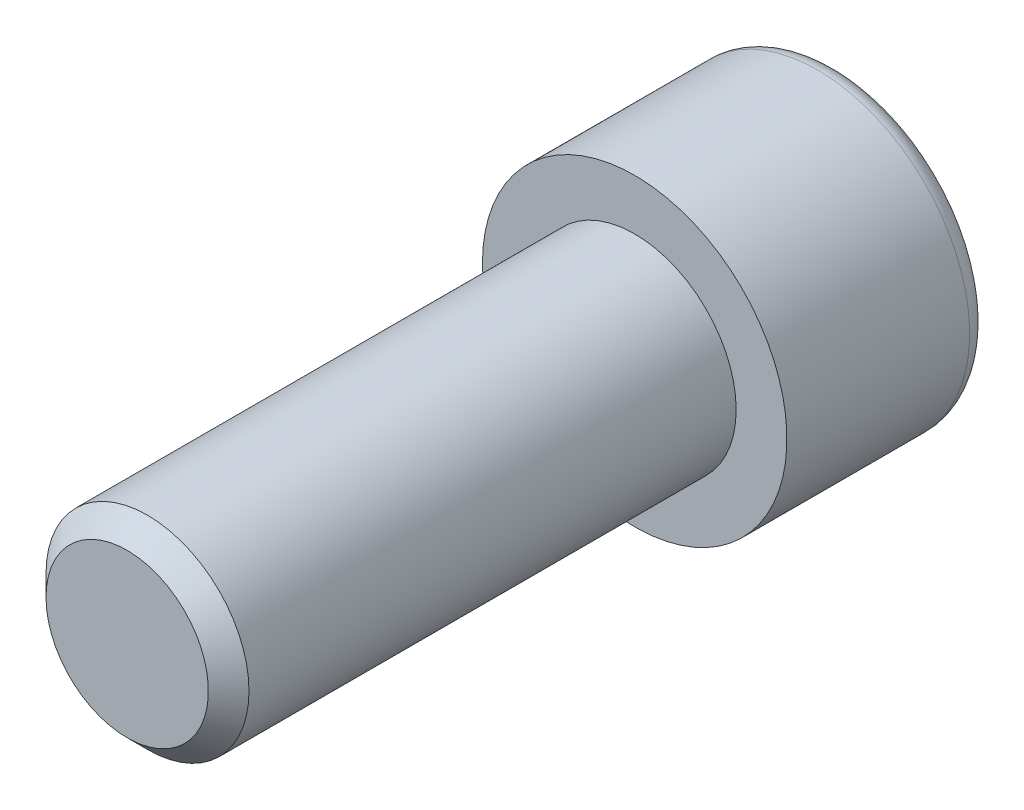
ISO-10303-21;
HEADER;
FILE_DESCRIPTION(('STEP AP214'),'2;1');
FILE_NAME('part.step','',(''),(''),'','','');
FILE_SCHEMA(('AUTOMOTIVE_DESIGN { 1 0 10303 214 1 1 1 1 }'));
ENDSEC;
DATA;
#1=APPLICATION_CONTEXT('core data for automotive mechanical design processes');
#2=APPLICATION_PROTOCOL_DEFINITION('international standard','automotive_design',2000,#1);
#3=PRODUCT_CONTEXT('',#1,'mechanical');
#4=PRODUCT('Part','Part','',(#3));
#5=PRODUCT_RELATED_PRODUCT_CATEGORY('part','',(#4));
#6=PRODUCT_DEFINITION_FORMATION('','',#4);
#7=PRODUCT_DEFINITION_CONTEXT('part definition',#1,'design');
#8=PRODUCT_DEFINITION('design','',#6,#7);
#9=PRODUCT_DEFINITION_SHAPE('','',#8);
#10=(LENGTH_UNIT() NAMED_UNIT(*) SI_UNIT(.MILLI.,.METRE.));
#11=(NAMED_UNIT(*) PLANE_ANGLE_UNIT() SI_UNIT($,.RADIAN.));
#12=(NAMED_UNIT(*) SI_UNIT($,.STERADIAN.) SOLID_ANGLE_UNIT());
#13=UNCERTAINTY_MEASURE_WITH_UNIT(LENGTH_MEASURE(1.E-05),#10,'distance_accuracy_value','');
#14=(GEOMETRIC_REPRESENTATION_CONTEXT(3) GLOBAL_UNCERTAINTY_ASSIGNED_CONTEXT((#13)) GLOBAL_UNIT_ASSIGNED_CONTEXT((#10,
#11,#12)) REPRESENTATION_CONTEXT('',''));
#15=CARTESIAN_POINT('',(0.,0.,0.));
#16=DIRECTION('',(0.,0.,1.));
#17=DIRECTION('',(1.,0.,0.));
#18=AXIS2_PLACEMENT_3D('',#15,#16,#17);
#19=CARTESIAN_POINT('',(0.,0.,-12.));
#20=DIRECTION('',(0.,0.,1.));
#21=DIRECTION('',(1.,0.,0.));
#22=AXIS2_PLACEMENT_3D('',#19,#20,#21);
#23=PLANE('',#22);
#24=CARTESIAN_POINT('',(0.,0.,-12.));
#25=DIRECTION('',(0.,0.,-1.));
#26=DIRECTION('',(-1.,0.,0.));
#27=AXIS2_PLACEMENT_3D('',#24,#25,#26);
#28=CIRCLE('',#27,7.8);
#29=CARTESIAN_POINT('',(-7.8,0.,-12.));
#30=VERTEX_POINT('',#29);
#31=EDGE_CURVE('E141',#30,#30,#28,.T.);
#32=ORIENTED_EDGE('',*,*,#31,.T.);
#33=EDGE_LOOP('',(#32));
#34=FACE_BOUND('',#33,.T.);
#35=DIRECTION('',(-0.86602540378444,0.499999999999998,0.));
#36=VECTOR('',#35,1.);
#37=CARTESIAN_POINT('',(0.,5.77350269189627,-12.));
#38=LINE('',#37,#36);
#39=CARTESIAN_POINT('',(5.,2.88675134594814,-12.));
#40=VERTEX_POINT('',#39);
#41=CARTESIAN_POINT('',(0.,5.77350269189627,-12.));
#42=VERTEX_POINT('',#41);
#43=EDGE_CURVE('E45',#40,#42,#38,.T.);
#44=ORIENTED_EDGE('',*,*,#43,.T.);
#45=DIRECTION('',(-0.866025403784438,-0.500000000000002,0.));
#46=VECTOR('',#45,1.);
#47=CARTESIAN_POINT('',(0.,5.77350269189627,-12.));
#48=LINE('',#47,#46);
#49=CARTESIAN_POINT('',(-5.,2.88675134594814,-12.));
#50=VERTEX_POINT('',#49);
#51=EDGE_CURVE('E85',#42,#50,#48,.T.);
#52=ORIENTED_EDGE('',*,*,#51,.T.);
#53=DIRECTION('',(0.,-1.,0.));
#54=VECTOR('',#53,1.);
#55=CARTESIAN_POINT('',(-5.,-2.88675134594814,-12.));
#56=LINE('',#55,#54);
#57=CARTESIAN_POINT('',(-5.,-2.88675134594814,-12.));
#58=VERTEX_POINT('',#57);
#59=EDGE_CURVE('E93',#50,#58,#56,.T.);
#60=ORIENTED_EDGE('',*,*,#59,.T.);
#61=DIRECTION('',(0.866025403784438,-0.500000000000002,0.));
#62=VECTOR('',#61,1.);
#63=CARTESIAN_POINT('',(0.,-5.77350269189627,-12.));
#64=LINE('',#63,#62);
#65=CARTESIAN_POINT('',(0.,-5.77350269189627,-12.));
#66=VERTEX_POINT('',#65);
#67=EDGE_CURVE('E111',#58,#66,#64,.T.);
#68=ORIENTED_EDGE('',*,*,#67,.T.);
#69=DIRECTION('',(0.86602540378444,0.499999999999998,0.));
#70=VECTOR('',#69,1.);
#71=CARTESIAN_POINT('',(0.,-5.77350269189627,-12.));
#72=LINE('',#71,#70);
#73=CARTESIAN_POINT('',(5.,-2.88675134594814,-12.));
#74=VERTEX_POINT('',#73);
#75=EDGE_CURVE('E114',#66,#74,#72,.T.);
#76=ORIENTED_EDGE('',*,*,#75,.T.);
#77=DIRECTION('',(0.,1.,0.));
#78=VECTOR('',#77,1.);
#79=CARTESIAN_POINT('',(5.,-2.88675134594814,-12.));
#80=LINE('',#79,#78);
#81=EDGE_CURVE('E104',#74,#40,#80,.T.);
#82=ORIENTED_EDGE('',*,*,#81,.T.);
#83=EDGE_LOOP('',(#44,#52,#60,#68,#76,#82));
#84=FACE_BOUND('',#83,.T.);
#85=ADVANCED_FACE('F31',(#34,#84),#23,.F.);
#86=CARTESIAN_POINT('',(0.,0.,-10.8));
#87=DIRECTION('',(0.,0.,-1.));
#88=DIRECTION('',(-1.,0.,0.));
#89=AXIS2_PLACEMENT_3D('',#86,#87,#88);
#90=TOROIDAL_SURFACE('',#89,7.8,1.2);
#91=ORIENTED_EDGE('',*,*,#31,.F.);
#92=EDGE_LOOP('',(#91));
#93=FACE_BOUND('',#92,.T.);
#94=CARTESIAN_POINT('',(0.,0.,-10.8));
#95=DIRECTION('',(0.,0.,-1.));
#96=DIRECTION('',(-1.,0.,0.));
#97=AXIS2_PLACEMENT_3D('',#94,#95,#96);
#98=CIRCLE('',#97,9.);
#99=CARTESIAN_POINT('',(-9.,0.,-10.8));
#100=VERTEX_POINT('',#99);
#101=EDGE_CURVE('E138',#100,#100,#98,.T.);
#102=ORIENTED_EDGE('',*,*,#101,.T.);
#103=EDGE_LOOP('',(#102));
#104=FACE_BOUND('',#103,.T.);
#105=ADVANCED_FACE('F160',(#93,#104),#90,.T.);
#106=CARTESIAN_POINT('',(0.,0.,0.));
#107=DIRECTION('',(0.,0.,-1.));
#108=DIRECTION('',(-1.,0.,0.));
#109=AXIS2_PLACEMENT_3D('',#106,#107,#108);
#110=CYLINDRICAL_SURFACE('',#109,9.);
#111=ORIENTED_EDGE('',*,*,#101,.F.);
#112=EDGE_LOOP('',(#111));
#113=FACE_BOUND('',#112,.T.);
#114=CARTESIAN_POINT('',(0.,0.,0.));
#115=DIRECTION('',(0.,0.,-1.));
#116=DIRECTION('',(-1.,0.,0.));
#117=AXIS2_PLACEMENT_3D('',#114,#115,#116);
#118=CIRCLE('',#117,9.);
#119=CARTESIAN_POINT('',(-9.,0.,0.));
#120=VERTEX_POINT('',#119);
#121=EDGE_CURVE('E99',#120,#120,#118,.T.);
#122=ORIENTED_EDGE('',*,*,#121,.T.);
#123=EDGE_LOOP('',(#122));
#124=FACE_BOUND('',#123,.T.);
#125=ADVANCED_FACE('F165',(#113,#124),#110,.T.);
#126=CARTESIAN_POINT('',(0.,0.,0.));
#127=DIRECTION('',(0.,0.,-1.));
#128=DIRECTION('',(-1.,0.,0.));
#129=AXIS2_PLACEMENT_3D('',#126,#127,#128);
#130=PLANE('',#129);
#131=CARTESIAN_POINT('',(0.,0.,0.));
#132=DIRECTION('',(0.,0.,1.));
#133=DIRECTION('',(1.,0.,0.));
#134=AXIS2_PLACEMENT_3D('',#131,#132,#133);
#135=CIRCLE('',#134,6.);
#136=CARTESIAN_POINT('',(6.,0.,0.));
#137=VERTEX_POINT('',#136);
#138=EDGE_CURVE('E105',#137,#137,#135,.T.);
#139=ORIENTED_EDGE('',*,*,#138,.F.);
#140=EDGE_LOOP('',(#139));
#141=FACE_BOUND('',#140,.T.);
#142=ORIENTED_EDGE('',*,*,#121,.F.);
#143=EDGE_LOOP('',(#142));
#144=FACE_BOUND('',#143,.T.);
#145=ADVANCED_FACE('F173',(#141,#144),#130,.F.);
#146=CARTESIAN_POINT('',(0.,5.77350269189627,-6.));
#147=DIRECTION('',(-0.499999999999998,-0.86602540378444,0.));
#148=DIRECTION('',(0.86602540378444,-0.499999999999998,0.));
#149=AXIS2_PLACEMENT_3D('',#146,#147,#148);
#150=PLANE('',#149);
#151=ORIENTED_EDGE('',*,*,#43,.F.);
#152=DIRECTION('',(0.,0.,-1.));
#153=VECTOR('',#152,1.);
#154=CARTESIAN_POINT('',(5.,2.88675134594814,-6.));
#155=LINE('',#154,#153);
#156=CARTESIAN_POINT('',(5.,2.88675134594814,-6.));
#157=VERTEX_POINT('',#156);
#158=EDGE_CURVE('E127',#157,#40,#155,.T.);
#159=ORIENTED_EDGE('',*,*,#158,.F.);
#160=DIRECTION('',(-0.86602540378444,0.499999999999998,0.));
#161=VECTOR('',#160,1.);
#162=CARTESIAN_POINT('',(0.,5.77350269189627,-6.));
#163=LINE('',#162,#161);
#164=CARTESIAN_POINT('',(0.,5.77350269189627,-6.));
#165=VERTEX_POINT('',#164);
#166=EDGE_CURVE('E98',#157,#165,#163,.T.);
#167=ORIENTED_EDGE('',*,*,#166,.T.);
#168=DIRECTION('',(0.,0.,-1.));
#169=VECTOR('',#168,1.);
#170=CARTESIAN_POINT('',(0.,5.77350269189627,-6.));
#171=LINE('',#170,#169);
#172=EDGE_CURVE('E87',#165,#42,#171,.T.);
#173=ORIENTED_EDGE('',*,*,#172,.T.);
#174=EDGE_LOOP('',(#151,#159,#167,#173));
#175=FACE_BOUND('',#174,.T.);
#176=ADVANCED_FACE('F96',(#175),#150,.T.);
#177=CARTESIAN_POINT('',(0.,5.77350269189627,-6.));
#178=DIRECTION('',(0.500000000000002,-0.866025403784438,0.));
#179=DIRECTION('',(0.866025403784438,0.500000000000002,0.));
#180=AXIS2_PLACEMENT_3D('',#177,#178,#179);
#181=PLANE('',#180);
#182=ORIENTED_EDGE('',*,*,#51,.F.);
#183=ORIENTED_EDGE('',*,*,#172,.F.);
#184=DIRECTION('',(-0.866025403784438,-0.500000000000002,0.));
#185=VECTOR('',#184,1.);
#186=CARTESIAN_POINT('',(0.,5.77350269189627,-6.));
#187=LINE('',#186,#185);
#188=CARTESIAN_POINT('',(-5.,2.88675134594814,-6.));
#189=VERTEX_POINT('',#188);
#190=EDGE_CURVE('E118',#165,#189,#187,.T.);
#191=ORIENTED_EDGE('',*,*,#190,.T.);
#192=DIRECTION('',(0.,0.,-1.));
#193=VECTOR('',#192,1.);
#194=CARTESIAN_POINT('',(-5.,2.88675134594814,-6.));
#195=LINE('',#194,#193);
#196=EDGE_CURVE('E89',#189,#50,#195,.T.);
#197=ORIENTED_EDGE('',*,*,#196,.T.);
#198=EDGE_LOOP('',(#182,#183,#191,#197));
#199=FACE_BOUND('',#198,.T.);
#200=ADVANCED_FACE('F86',(#199),#181,.T.);
#201=CARTESIAN_POINT('',(-5.,-2.88675134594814,-6.));
#202=DIRECTION('',(1.,0.,0.));
#203=DIRECTION('',(0.,0.,-1.));
#204=AXIS2_PLACEMENT_3D('',#201,#202,#203);
#205=PLANE('',#204);
#206=ORIENTED_EDGE('',*,*,#59,.F.);
#207=ORIENTED_EDGE('',*,*,#196,.F.);
#208=DIRECTION('',(0.,-1.,0.));
#209=VECTOR('',#208,1.);
#210=CARTESIAN_POINT('',(-5.,-2.88675134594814,-6.));
#211=LINE('',#210,#209);
#212=CARTESIAN_POINT('',(-5.,-2.88675134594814,-6.));
#213=VERTEX_POINT('',#212);
#214=EDGE_CURVE('E120',#189,#213,#211,.T.);
#215=ORIENTED_EDGE('',*,*,#214,.T.);
#216=DIRECTION('',(0.,0.,-1.));
#217=VECTOR('',#216,1.);
#218=CARTESIAN_POINT('',(-5.,-2.88675134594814,-6.));
#219=LINE('',#218,#217);
#220=EDGE_CURVE('E133',#213,#58,#219,.T.);
#221=ORIENTED_EDGE('',*,*,#220,.T.);
#222=EDGE_LOOP('',(#206,#207,#215,#221));
#223=FACE_BOUND('',#222,.T.);
#224=ADVANCED_FACE('F188',(#223),#205,.T.);
#225=CARTESIAN_POINT('',(0.,-5.77350269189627,-6.));
#226=DIRECTION('',(0.500000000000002,0.866025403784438,0.));
#227=DIRECTION('',(-0.866025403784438,0.500000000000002,0.));
#228=AXIS2_PLACEMENT_3D('',#225,#226,#227);
#229=PLANE('',#228);
#230=ORIENTED_EDGE('',*,*,#67,.F.);
#231=ORIENTED_EDGE('',*,*,#220,.F.);
#232=DIRECTION('',(0.866025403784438,-0.500000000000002,0.));
#233=VECTOR('',#232,1.);
#234=CARTESIAN_POINT('',(0.,-5.77350269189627,-6.));
#235=LINE('',#234,#233);
#236=CARTESIAN_POINT('',(0.,-5.77350269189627,-6.));
#237=VERTEX_POINT('',#236);
#238=EDGE_CURVE('E122',#213,#237,#235,.T.);
#239=ORIENTED_EDGE('',*,*,#238,.T.);
#240=DIRECTION('',(0.,0.,-1.));
#241=VECTOR('',#240,1.);
#242=CARTESIAN_POINT('',(0.,-5.77350269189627,-6.));
#243=LINE('',#242,#241);
#244=EDGE_CURVE('E131',#237,#66,#243,.T.);
#245=ORIENTED_EDGE('',*,*,#244,.T.);
#246=EDGE_LOOP('',(#230,#231,#239,#245));
#247=FACE_BOUND('',#246,.T.);
#248=ADVANCED_FACE('F191',(#247),#229,.T.);
#249=CARTESIAN_POINT('',(0.,-5.77350269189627,-6.));
#250=DIRECTION('',(-0.499999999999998,0.86602540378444,0.));
#251=DIRECTION('',(-0.86602540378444,-0.499999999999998,0.));
#252=AXIS2_PLACEMENT_3D('',#249,#250,#251);
#253=PLANE('',#252);
#254=ORIENTED_EDGE('',*,*,#75,.F.);
#255=ORIENTED_EDGE('',*,*,#244,.F.);
#256=DIRECTION('',(0.86602540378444,0.499999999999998,0.));
#257=VECTOR('',#256,1.);
#258=CARTESIAN_POINT('',(0.,-5.77350269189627,-6.));
#259=LINE('',#258,#257);
#260=CARTESIAN_POINT('',(5.,-2.88675134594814,-6.));
#261=VERTEX_POINT('',#260);
#262=EDGE_CURVE('E124',#237,#261,#259,.T.);
#263=ORIENTED_EDGE('',*,*,#262,.T.);
#264=DIRECTION('',(0.,0.,-1.));
#265=VECTOR('',#264,1.);
#266=CARTESIAN_POINT('',(5.,-2.88675134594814,-6.));
#267=LINE('',#266,#265);
#268=EDGE_CURVE('E129',#261,#74,#267,.T.);
#269=ORIENTED_EDGE('',*,*,#268,.T.);
#270=EDGE_LOOP('',(#254,#255,#263,#269));
#271=FACE_BOUND('',#270,.T.);
#272=ADVANCED_FACE('F195',(#271),#253,.T.);
#273=CARTESIAN_POINT('',(5.,-2.88675134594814,-6.));
#274=DIRECTION('',(-1.,0.,0.));
#275=DIRECTION('',(0.,0.,1.));
#276=AXIS2_PLACEMENT_3D('',#273,#274,#275);
#277=PLANE('',#276);
#278=ORIENTED_EDGE('',*,*,#81,.F.);
#279=ORIENTED_EDGE('',*,*,#268,.F.);
#280=DIRECTION('',(0.,1.,0.));
#281=VECTOR('',#280,1.);
#282=CARTESIAN_POINT('',(5.,-2.88675134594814,-6.));
#283=LINE('',#282,#281);
#284=EDGE_CURVE('E52',#261,#157,#283,.T.);
#285=ORIENTED_EDGE('',*,*,#284,.T.);
#286=ORIENTED_EDGE('',*,*,#158,.T.);
#287=EDGE_LOOP('',(#278,#279,#285,#286));
#288=FACE_BOUND('',#287,.T.);
#289=ADVANCED_FACE('F199',(#288),#277,.T.);
#290=CARTESIAN_POINT('',(5.,2.88675134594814,-6.));
#291=DIRECTION('',(0.,0.,1.));
#292=DIRECTION('',(1.,0.,0.));
#293=AXIS2_PLACEMENT_3D('',#290,#291,#292);
#294=PLANE('',#293);
#295=ORIENTED_EDGE('',*,*,#166,.F.);
#296=ORIENTED_EDGE('',*,*,#284,.F.);
#297=ORIENTED_EDGE('',*,*,#262,.F.);
#298=ORIENTED_EDGE('',*,*,#238,.F.);
#299=ORIENTED_EDGE('',*,*,#214,.F.);
#300=ORIENTED_EDGE('',*,*,#190,.F.);
#301=EDGE_LOOP('',(#295,#296,#297,#298,#299,#300));
#302=FACE_BOUND('',#301,.T.);
#303=ADVANCED_FACE('F203',(#302),#294,.F.);
#304=CARTESIAN_POINT('',(0.,0.,30.));
#305=DIRECTION('',(0.,0.,1.));
#306=DIRECTION('',(1.,0.,0.));
#307=AXIS2_PLACEMENT_3D('',#304,#305,#306);
#308=PLANE('',#307);
#309=CARTESIAN_POINT('',(0.,0.,30.));
#310=DIRECTION('',(0.,0.,1.));
#311=DIRECTION('',(1.,0.,0.));
#312=AXIS2_PLACEMENT_3D('',#309,#310,#311);
#313=CIRCLE('',#312,4.8);
#314=CARTESIAN_POINT('',(-4.8,0.,30.));
#315=VERTEX_POINT('',#314);
#316=EDGE_CURVE('E38',#315,#315,#313,.T.);
#317=ORIENTED_EDGE('',*,*,#316,.T.);
#318=EDGE_LOOP('',(#317));
#319=FACE_BOUND('',#318,.T.);
#320=ADVANCED_FACE('F146',(#319),#308,.T.);
#321=CARTESIAN_POINT('',(0.,0.,0.));
#322=DIRECTION('',(0.,0.,1.));
#323=DIRECTION('',(1.,0.,0.));
#324=AXIS2_PLACEMENT_3D('',#321,#322,#323);
#325=CYLINDRICAL_SURFACE('',#324,6.);
#326=CARTESIAN_POINT('',(0.,0.,28.8));
#327=DIRECTION('',(0.,0.,1.));
#328=DIRECTION('',(1.,0.,0.));
#329=AXIS2_PLACEMENT_3D('',#326,#327,#328);
#330=CIRCLE('',#329,6.);
#331=CARTESIAN_POINT('',(-5.99999999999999,0.,28.8));
#332=VERTEX_POINT('',#331);
#333=EDGE_CURVE('E11',#332,#332,#330,.F.);
#334=ORIENTED_EDGE('',*,*,#333,.T.);
#335=EDGE_LOOP('',(#334));
#336=FACE_BOUND('',#335,.T.);
#337=ORIENTED_EDGE('',*,*,#138,.T.);
#338=EDGE_LOOP('',(#337));
#339=FACE_BOUND('',#338,.T.);
#340=ADVANCED_FACE('F150',(#336,#339),#325,.T.);
#341=CARTESIAN_POINT('',(0.,0.,30.));
#342=DIRECTION('',(0.,0.,-1.));
#343=DIRECTION('',(-1.,0.,0.));
#344=AXIS2_PLACEMENT_3D('',#341,#342,#343);
#345=CONICAL_SURFACE('',#344,4.8,0.785398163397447);
#346=CARTESIAN_POINT('',(-5.99999999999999,0.,28.8));
#347=CARTESIAN_POINT('',(-5.9875,0.,28.8125));
#348=CARTESIAN_POINT('',(-5.975,0.,28.825));
#349=CARTESIAN_POINT('',(-5.95,0.,28.85));
#350=CARTESIAN_POINT('',(-5.9375,0.,28.8625));
#351=CARTESIAN_POINT('',(-5.9125,0.,28.8875));
#352=CARTESIAN_POINT('',(-5.9,0.,28.9));
#353=CARTESIAN_POINT('',(-5.875,0.,28.925));
#354=CARTESIAN_POINT('',(-5.8625,0.,28.9375));
#355=CARTESIAN_POINT('',(-5.8375,0.,28.9625));
#356=CARTESIAN_POINT('',(-5.825,0.,28.975));
#357=CARTESIAN_POINT('',(-5.8,0.,29.));
#358=CARTESIAN_POINT('',(-5.7875,0.,29.0125));
#359=CARTESIAN_POINT('',(-5.76249999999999,0.,29.0375));
#360=CARTESIAN_POINT('',(-5.74999999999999,0.,29.05));
#361=CARTESIAN_POINT('',(-5.725,0.,29.075));
#362=CARTESIAN_POINT('',(-5.7125,0.,29.0875));
#363=CARTESIAN_POINT('',(-5.6875,0.,29.1125));
#364=CARTESIAN_POINT('',(-5.675,0.,29.125));
#365=CARTESIAN_POINT('',(-5.65,0.,29.15));
#366=CARTESIAN_POINT('',(-5.6375,0.,29.1625));
#367=CARTESIAN_POINT('',(-5.6125,0.,29.1875));
#368=CARTESIAN_POINT('',(-5.6,0.,29.2));
#369=CARTESIAN_POINT('',(-5.575,0.,29.225));
#370=CARTESIAN_POINT('',(-5.5625,0.,29.2375));
#371=CARTESIAN_POINT('',(-5.5375,0.,29.2625));
#372=CARTESIAN_POINT('',(-5.525,0.,29.275));
#373=CARTESIAN_POINT('',(-5.5,0.,29.3));
#374=CARTESIAN_POINT('',(-5.4875,0.,29.3125));
#375=CARTESIAN_POINT('',(-5.4625,0.,29.3375));
#376=CARTESIAN_POINT('',(-5.45,0.,29.35));
#377=CARTESIAN_POINT('',(-5.42499999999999,0.,29.375));
#378=CARTESIAN_POINT('',(-5.4125,0.,29.3875));
#379=CARTESIAN_POINT('',(-5.3875,0.,29.4125));
#380=CARTESIAN_POINT('',(-5.375,0.,29.425));
#381=CARTESIAN_POINT('',(-5.35,0.,29.45));
#382=CARTESIAN_POINT('',(-5.3375,0.,29.4625));
#383=CARTESIAN_POINT('',(-5.3125,0.,29.4875));
#384=CARTESIAN_POINT('',(-5.3,0.,29.5));
#385=CARTESIAN_POINT('',(-5.275,0.,29.525));
#386=CARTESIAN_POINT('',(-5.2625,0.,29.5375));
#387=CARTESIAN_POINT('',(-5.2375,0.,29.5625));
#388=CARTESIAN_POINT('',(-5.225,0.,29.575));
#389=CARTESIAN_POINT('',(-5.2,0.,29.6));
#390=CARTESIAN_POINT('',(-5.18749999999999,0.,29.6125));
#391=CARTESIAN_POINT('',(-5.1625,0.,29.6375));
#392=CARTESIAN_POINT('',(-5.15,0.,29.65));
#393=CARTESIAN_POINT('',(-5.125,0.,29.675));
#394=CARTESIAN_POINT('',(-5.1125,0.,29.6875));
#395=CARTESIAN_POINT('',(-5.0875,0.,29.7125));
#396=CARTESIAN_POINT('',(-5.075,0.,29.725));
#397=CARTESIAN_POINT('',(-5.05,0.,29.75));
#398=CARTESIAN_POINT('',(-5.0375,0.,29.7625));
#399=CARTESIAN_POINT('',(-5.01249999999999,0.,29.7875));
#400=CARTESIAN_POINT('',(-5.,0.,29.8));
#401=CARTESIAN_POINT('',(-4.975,0.,29.825));
#402=CARTESIAN_POINT('',(-4.9625,0.,29.8375));
#403=CARTESIAN_POINT('',(-4.9375,0.,29.8625));
#404=CARTESIAN_POINT('',(-4.925,0.,29.875));
#405=CARTESIAN_POINT('',(-4.9,0.,29.9));
#406=CARTESIAN_POINT('',(-4.8875,0.,29.9125));
#407=CARTESIAN_POINT('',(-4.8625,0.,29.9375));
#408=CARTESIAN_POINT('',(-4.85,0.,29.95));
#409=CARTESIAN_POINT('',(-4.825,0.,29.975));
#410=CARTESIAN_POINT('',(-4.8125,0.,29.9875));
#411=CARTESIAN_POINT('',(-4.8,0.,30.));
#412=B_SPLINE_CURVE_WITH_KNOTS('',3,(#346,#347,#348,#349,#350,#351,#352,#353,#354,#355,#356,
#357,#358,#359,#360,#361,#362,#363,#364,#365,#366,#367,#368,#369,#370,#371,#372,#373,#374,#375,
#376,#377,#378,#379,#380,#381,#382,#383,#384,#385,#386,#387,#388,#389,#390,#391,#392,#393,#394,
#395,#396,#397,#398,#399,#400,#401,#402,#403,#404,#405,#406,#407,#408,#409,#410,#411),
.UNSPECIFIED.,.F.,.F.,(4,2,2,2,2,2,2,2,2,2,2,2,2,2,2,2,2,2,2,2,2,2,2,2,2,2,2,2,2,2,2,2,4),(0.,
0.0530330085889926,0.106066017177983,0.159099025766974,0.212132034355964,0.265165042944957,
0.318198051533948,0.371231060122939,0.424264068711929,0.47729707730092,0.530330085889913,
0.583363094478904,0.636396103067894,0.689429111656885,0.742462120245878,0.795495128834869,
0.848528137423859,0.901561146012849,0.95459415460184,1.00762716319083,1.06066017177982,
1.11369318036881,1.1667261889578,1.2197591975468,1.27279220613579,1.32582521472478,
1.37885822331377,1.43189123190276,1.48492424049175,1.53795724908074,1.59099025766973,
1.64402326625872,1.69705627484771),.UNSPECIFIED.);
#413=EDGE_CURVE('BSEAM148',#332,#315,#412,.T.);
#414=ORIENTED_EDGE('',*,*,#333,.F.);
#415=ORIENTED_EDGE('',*,*,#316,.F.);
#416=ORIENTED_EDGE('',*,*,#413,.T.);
#417=ORIENTED_EDGE('',*,*,#413,.F.);
#418=EDGE_LOOP('',(#414,#416,#415,#417));
#419=FACE_BOUND('',#418,.T.);
#420=ADVANCED_FACE('F148',(#419),#345,.T.);
#421=CLOSED_SHELL('',(#85,#105,#125,#145,#176,#200,#224,#248,#272,#289,#303,#320,#340,#420));
#422=MANIFOLD_SOLID_BREP('B2',#421);
#423=ADVANCED_BREP_SHAPE_REPRESENTATION('',(#18,#422),#14);
#424=SHAPE_DEFINITION_REPRESENTATION(#9,#423);
ENDSEC;
END-ISO-10303-21;
